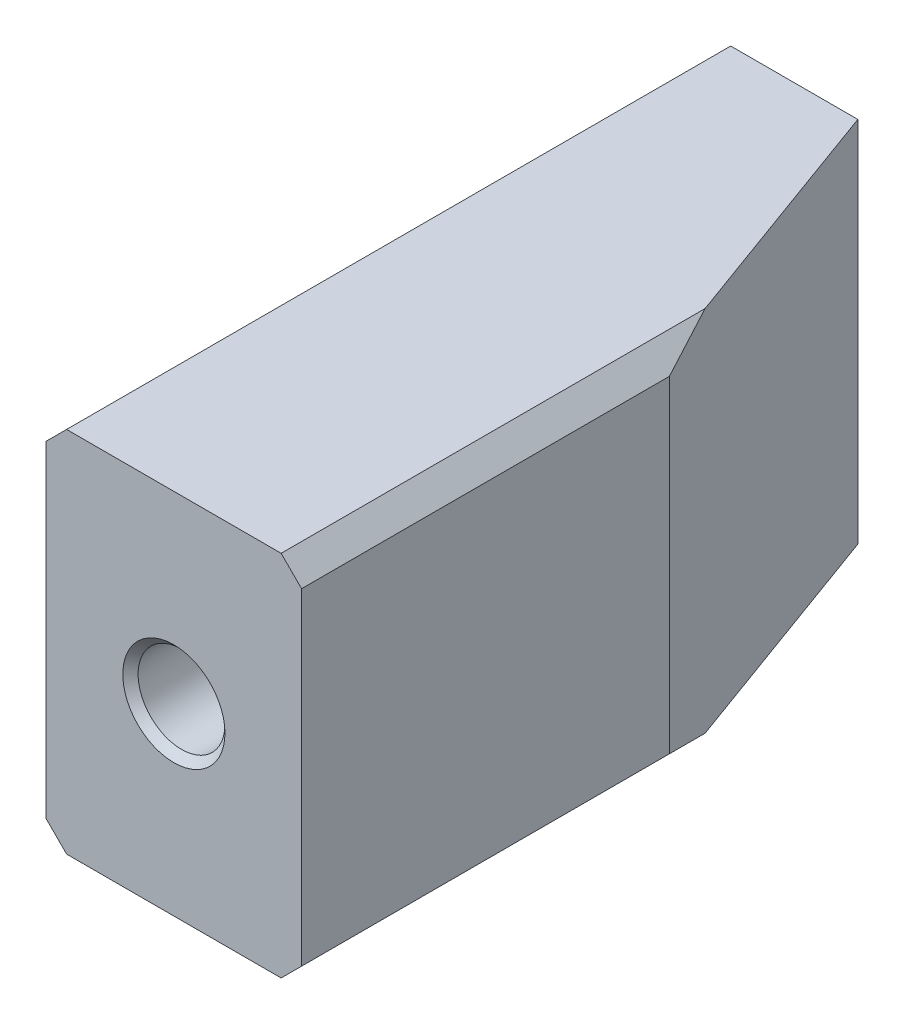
ISO-10303-21;
HEADER;
FILE_DESCRIPTION(('STEP AP214'),'2;1');
FILE_NAME('part.step','',(''),(''),'','','');
FILE_SCHEMA(('AUTOMOTIVE_DESIGN { 1 0 10303 214 1 1 1 1 }'));
ENDSEC;
DATA;
#1=APPLICATION_CONTEXT('core data for automotive mechanical design processes');
#2=APPLICATION_PROTOCOL_DEFINITION('international standard','automotive_design',2000,#1);
#3=PRODUCT_CONTEXT('',#1,'mechanical');
#4=PRODUCT('Part','Part','',(#3));
#5=PRODUCT_RELATED_PRODUCT_CATEGORY('part','',(#4));
#6=PRODUCT_DEFINITION_FORMATION('','',#4);
#7=PRODUCT_DEFINITION_CONTEXT('part definition',#1,'design');
#8=PRODUCT_DEFINITION('design','',#6,#7);
#9=PRODUCT_DEFINITION_SHAPE('','',#8);
#10=(LENGTH_UNIT() NAMED_UNIT(*) SI_UNIT(.MILLI.,.METRE.));
#11=(NAMED_UNIT(*) PLANE_ANGLE_UNIT() SI_UNIT($,.RADIAN.));
#12=(NAMED_UNIT(*) SI_UNIT($,.STERADIAN.) SOLID_ANGLE_UNIT());
#13=UNCERTAINTY_MEASURE_WITH_UNIT(LENGTH_MEASURE(1.E-05),#10,'distance_accuracy_value','');
#14=(GEOMETRIC_REPRESENTATION_CONTEXT(3) GLOBAL_UNCERTAINTY_ASSIGNED_CONTEXT((#13)) GLOBAL_UNIT_ASSIGNED_CONTEXT((#10,
#11,#12)) REPRESENTATION_CONTEXT('',''));
#15=CARTESIAN_POINT('',(0.,0.,0.));
#16=DIRECTION('',(0.,0.,1.));
#17=DIRECTION('',(1.,0.,0.));
#18=AXIS2_PLACEMENT_3D('',#15,#16,#17);
#19=CARTESIAN_POINT('',(-187.,-23.85,36.));
#20=DIRECTION('',(-1.,0.,0.));
#21=DIRECTION('',(0.,0.,1.));
#22=AXIS2_PLACEMENT_3D('',#19,#20,#21);
#23=PLANE('',#22);
#24=DIRECTION('',(0.,-1.,0.));
#25=VECTOR('',#24,1.);
#26=CARTESIAN_POINT('',(-187.,-23.85,36.));
#27=LINE('',#26,#25);
#28=CARTESIAN_POINT('',(-187.,-25.85,36.));
#29=VERTEX_POINT('',#28);
#30=CARTESIAN_POINT('',(-187.,-57.85,36.));
#31=VERTEX_POINT('',#30);
#32=EDGE_CURVE('E124',#29,#31,#27,.T.);
#33=ORIENTED_EDGE('',*,*,#32,.F.);
#34=DIRECTION('',(0.,0.,-1.));
#35=VECTOR('',#34,1.);
#36=CARTESIAN_POINT('',(-187.,-25.85,-29.));
#37=LINE('',#36,#35);
#38=CARTESIAN_POINT('',(-187.,-25.85,-29.));
#39=VERTEX_POINT('',#38);
#40=EDGE_CURVE('E178',#29,#39,#37,.T.);
#41=ORIENTED_EDGE('',*,*,#40,.T.);
#42=DIRECTION('',(0.,-1.,0.));
#43=VECTOR('',#42,1.);
#44=CARTESIAN_POINT('',(-187.,-23.85,-29.));
#45=LINE('',#44,#43);
#46=CARTESIAN_POINT('',(-187.,-57.85,-29.));
#47=VERTEX_POINT('',#46);
#48=EDGE_CURVE('E106',#39,#47,#45,.T.);
#49=ORIENTED_EDGE('',*,*,#48,.T.);
#50=DIRECTION('',(0.,0.,1.));
#51=VECTOR('',#50,1.);
#52=CARTESIAN_POINT('',(-187.,-57.85,36.));
#53=LINE('',#52,#51);
#54=EDGE_CURVE('E132',#47,#31,#53,.T.);
#55=ORIENTED_EDGE('',*,*,#54,.T.);
#56=EDGE_LOOP('',(#33,#41,#49,#55));
#57=FACE_BOUND('',#56,.T.);
#58=ADVANCED_FACE('F16',(#57),#23,.T.);
#59=CARTESIAN_POINT('',(-187.,-23.85,-29.));
#60=DIRECTION('',(0.,-1.,0.));
#61=DIRECTION('',(0.,0.,-1.));
#62=AXIS2_PLACEMENT_3D('',#59,#60,#61);
#63=PLANE('',#62);
#64=DIRECTION('',(1.,0.,0.));
#65=VECTOR('',#64,1.);
#66=CARTESIAN_POINT('',(-187.,-23.85,-29.));
#67=LINE('',#66,#65);
#68=CARTESIAN_POINT('',(-185.,-23.85,-29.));
#69=VERTEX_POINT('',#68);
#70=CARTESIAN_POINT('',(-172.55513679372,-23.85,-29.));
#71=VERTEX_POINT('',#70);
#72=EDGE_CURVE('E90',#69,#71,#67,.T.);
#73=ORIENTED_EDGE('',*,*,#72,.F.);
#74=DIRECTION('',(0.,0.,1.));
#75=VECTOR('',#74,1.);
#76=CARTESIAN_POINT('',(-185.,-23.85,36.));
#77=LINE('',#76,#75);
#78=CARTESIAN_POINT('',(-185.,-23.85,36.));
#79=VERTEX_POINT('',#78);
#80=EDGE_CURVE('E165',#69,#79,#77,.T.);
#81=ORIENTED_EDGE('',*,*,#80,.T.);
#82=DIRECTION('',(-1.,0.,0.));
#83=VECTOR('',#82,1.);
#84=CARTESIAN_POINT('',(-162.,-23.85,36.));
#85=LINE('',#84,#83);
#86=CARTESIAN_POINT('',(-164.,-23.85,36.));
#87=VERTEX_POINT('',#86);
#88=EDGE_CURVE('E128',#87,#79,#85,.T.);
#89=ORIENTED_EDGE('',*,*,#88,.F.);
#90=DIRECTION('',(0.,0.,-1.));
#91=VECTOR('',#90,1.);
#92=CARTESIAN_POINT('',(-164.,-23.85,0.));
#93=LINE('',#92,#91);
#94=CARTESIAN_POINT('',(-164.,-23.85,-5.49495483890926));
#95=VERTEX_POINT('',#94);
#96=EDGE_CURVE('E111',#87,#95,#93,.T.);
#97=ORIENTED_EDGE('',*,*,#96,.T.);
#98=DIRECTION('',(0.342020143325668,0.,0.939692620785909));
#99=VECTOR('',#98,1.);
#100=CARTESIAN_POINT('',(-172.55513679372,-23.85,-29.));
#101=LINE('',#100,#99);
#102=EDGE_CURVE('E101',#71,#95,#101,.T.);
#103=ORIENTED_EDGE('',*,*,#102,.F.);
#104=EDGE_LOOP('',(#73,#81,#89,#97,#103));
#105=FACE_BOUND('',#104,.T.);
#106=ADVANCED_FACE('F108',(#105),#63,.F.);
#107=CARTESIAN_POINT('',(-187.,-59.85,-29.));
#108=DIRECTION('',(0.,-1.,0.));
#109=DIRECTION('',(0.,0.,-1.));
#110=AXIS2_PLACEMENT_3D('',#107,#108,#109);
#111=PLANE('',#110);
#112=DIRECTION('',(-1.,0.,0.));
#113=VECTOR('',#112,1.);
#114=CARTESIAN_POINT('',(-162.,-59.85,36.));
#115=LINE('',#114,#113);
#116=CARTESIAN_POINT('',(-164.,-59.85,36.));
#117=VERTEX_POINT('',#116);
#118=CARTESIAN_POINT('',(-185.,-59.85,36.));
#119=VERTEX_POINT('',#118);
#120=EDGE_CURVE('E119',#117,#119,#115,.T.);
#121=ORIENTED_EDGE('',*,*,#120,.T.);
#122=DIRECTION('',(0.,0.,-1.));
#123=VECTOR('',#122,1.);
#124=CARTESIAN_POINT('',(-185.,-59.85,-29.));
#125=LINE('',#124,#123);
#126=CARTESIAN_POINT('',(-185.,-59.85,-29.));
#127=VERTEX_POINT('',#126);
#128=EDGE_CURVE('E141',#119,#127,#125,.T.);
#129=ORIENTED_EDGE('',*,*,#128,.T.);
#130=DIRECTION('',(1.,0.,0.));
#131=VECTOR('',#130,1.);
#132=CARTESIAN_POINT('',(-187.,-59.85,-29.));
#133=LINE('',#132,#131);
#134=CARTESIAN_POINT('',(-172.55513679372,-59.85,-29.));
#135=VERTEX_POINT('',#134);
#136=EDGE_CURVE('E114',#127,#135,#133,.T.);
#137=ORIENTED_EDGE('',*,*,#136,.T.);
#138=DIRECTION('',(0.342020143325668,0.,0.939692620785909));
#139=VECTOR('',#138,1.);
#140=CARTESIAN_POINT('',(-172.55513679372,-59.85,-29.));
#141=LINE('',#140,#139);
#142=CARTESIAN_POINT('',(-164.,-59.85,-5.49495483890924));
#143=VERTEX_POINT('',#142);
#144=EDGE_CURVE('E102',#135,#143,#141,.T.);
#145=ORIENTED_EDGE('',*,*,#144,.T.);
#146=DIRECTION('',(0.,0.,1.));
#147=VECTOR('',#146,1.);
#148=CARTESIAN_POINT('',(-164.,-59.85,-29.));
#149=LINE('',#148,#147);
#150=EDGE_CURVE('E149',#143,#117,#149,.T.);
#151=ORIENTED_EDGE('',*,*,#150,.T.);
#152=EDGE_LOOP('',(#121,#129,#137,#145,#151));
#153=FACE_BOUND('',#152,.T.);
#154=ADVANCED_FACE('F197',(#153),#111,.T.);
#155=CARTESIAN_POINT('',(-162.,-23.85,0.));
#156=DIRECTION('',(1.,0.,0.));
#157=DIRECTION('',(0.,0.,-1.));
#158=AXIS2_PLACEMENT_3D('',#155,#156,#157);
#159=PLANE('',#158);
#160=DIRECTION('',(0.,-1.,0.));
#161=VECTOR('',#160,1.);
#162=CARTESIAN_POINT('',(-162.,-23.85,36.));
#163=LINE('',#162,#161);
#164=CARTESIAN_POINT('',(-162.,-25.85,36.));
#165=VERTEX_POINT('',#164);
#166=CARTESIAN_POINT('',(-162.,-57.85,36.));
#167=VERTEX_POINT('',#166);
#168=EDGE_CURVE('E129',#165,#167,#163,.T.);
#169=ORIENTED_EDGE('',*,*,#168,.T.);
#170=DIRECTION('',(0.,0.,-1.));
#171=VECTOR('',#170,1.);
#172=CARTESIAN_POINT('',(-162.,-57.85,0.));
#173=LINE('',#172,#171);
#174=CARTESIAN_POINT('',(-162.,-57.85,0.));
#175=VERTEX_POINT('',#174);
#176=EDGE_CURVE('E37',#167,#175,#173,.T.);
#177=ORIENTED_EDGE('',*,*,#176,.T.);
#178=DIRECTION('',(0.,1.,0.));
#179=VECTOR('',#178,1.);
#180=CARTESIAN_POINT('',(-162.,-23.85,0.));
#181=LINE('',#180,#179);
#182=CARTESIAN_POINT('',(-162.,-25.85,0.));
#183=VERTEX_POINT('',#182);
#184=EDGE_CURVE('E138',#175,#183,#181,.T.);
#185=ORIENTED_EDGE('',*,*,#184,.T.);
#186=DIRECTION('',(0.,0.,1.));
#187=VECTOR('',#186,1.);
#188=CARTESIAN_POINT('',(-162.,-25.85,36.));
#189=LINE('',#188,#187);
#190=EDGE_CURVE('E143',#183,#165,#189,.T.);
#191=ORIENTED_EDGE('',*,*,#190,.T.);
#192=EDGE_LOOP('',(#169,#177,#185,#191));
#193=FACE_BOUND('',#192,.T.);
#194=ADVANCED_FACE('F199',(#193),#159,.T.);
#195=CARTESIAN_POINT('',(-162.,-23.85,36.));
#196=DIRECTION('',(0.,0.,1.));
#197=DIRECTION('',(1.,0.,0.));
#198=AXIS2_PLACEMENT_3D('',#195,#196,#197);
#199=PLANE('',#198);
#200=CARTESIAN_POINT('',(-174.5,-41.85,36.));
#201=DIRECTION('',(0.,0.,1.));
#202=DIRECTION('',(1.,0.,0.));
#203=AXIS2_PLACEMENT_3D('',#200,#201,#202);
#204=CIRCLE('',#203,5.);
#205=CARTESIAN_POINT('',(-169.5,-41.85,36.));
#206=VERTEX_POINT('',#205);
#207=EDGE_CURVE('E125',#206,#206,#204,.F.);
#208=ORIENTED_EDGE('',*,*,#207,.T.);
#209=EDGE_LOOP('',(#208));
#210=FACE_BOUND('',#209,.T.);
#211=ORIENTED_EDGE('',*,*,#88,.T.);
#212=DIRECTION('',(-0.707106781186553,-0.707106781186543,0.));
#213=VECTOR('',#212,1.);
#214=CARTESIAN_POINT('',(-173.5,-12.3500000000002,36.));
#215=LINE('',#214,#213);
#216=EDGE_CURVE('E154',#79,#29,#215,.T.);
#217=ORIENTED_EDGE('',*,*,#216,.T.);
#218=ORIENTED_EDGE('',*,*,#32,.T.);
#219=DIRECTION('',(-0.707106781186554,0.707106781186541,0.));
#220=VECTOR('',#219,1.);
#221=CARTESIAN_POINT('',(-191.5,-53.35,36.));
#222=LINE('',#221,#220);
#223=EDGE_CURVE('E157',#31,#119,#222,.F.);
#224=ORIENTED_EDGE('',*,*,#223,.T.);
#225=ORIENTED_EDGE('',*,*,#120,.F.);
#226=DIRECTION('',(-0.707106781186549,-0.707106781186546,0.));
#227=VECTOR('',#226,1.);
#228=CARTESIAN_POINT('',(-145.,-40.85,36.));
#229=LINE('',#228,#227);
#230=EDGE_CURVE('E161',#117,#167,#229,.F.);
#231=ORIENTED_EDGE('',*,*,#230,.T.);
#232=ORIENTED_EDGE('',*,*,#168,.F.);
#233=DIRECTION('',(-0.707106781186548,0.707106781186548,0.));
#234=VECTOR('',#233,1.);
#235=CARTESIAN_POINT('',(-163.,-24.85,36.));
#236=LINE('',#235,#234);
#237=EDGE_CURVE('E163',#165,#87,#236,.T.);
#238=ORIENTED_EDGE('',*,*,#237,.T.);
#239=EDGE_LOOP('',(#211,#217,#218,#224,#225,#231,#232,#238));
#240=FACE_BOUND('',#239,.T.);
#241=ADVANCED_FACE('F188',(#210,#240),#199,.T.);
#242=CARTESIAN_POINT('',(-174.5,-41.85,16.));
#243=DIRECTION('',(0.,0.,1.));
#244=DIRECTION('',(1.,0.,0.));
#245=AXIS2_PLACEMENT_3D('',#242,#243,#244);
#246=CONICAL_SURFACE('',#245,4.25,1.02974425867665);
#247=CARTESIAN_POINT('',(-174.5,-41.85,16.));
#248=DIRECTION('',(0.,0.,-1.));
#249=DIRECTION('',(-1.,0.,0.));
#250=AXIS2_PLACEMENT_3D('',#247,#248,#249);
#251=CIRCLE('',#250,4.25);
#252=CARTESIAN_POINT('',(-178.75,-41.85,16.));
#253=VERTEX_POINT('',#252);
#254=EDGE_CURVE('E123',#253,#253,#251,.T.);
#255=ORIENTED_EDGE('',*,*,#254,.F.);
#256=EDGE_LOOP('',(#255));
#257=FACE_BOUND('',#256,.T.);
#258=CARTESIAN_POINT('',(-174.5,-41.85,13.4463423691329));
#259=VERTEX_POINT('',#258);
#260=VERTEX_LOOP('',#259);
#261=FACE_BOUND('',#260,.T.);
#262=ADVANCED_FACE('F285',(#257,#261),#246,.F.);
#263=CARTESIAN_POINT('',(-174.5,-41.85,36.));
#264=DIRECTION('',(0.,0.,-1.));
#265=DIRECTION('',(-1.,0.,0.));
#266=AXIS2_PLACEMENT_3D('',#263,#264,#265);
#267=CYLINDRICAL_SURFACE('',#266,4.25);
#268=CARTESIAN_POINT('',(-174.5,-41.85,35.25));
#269=DIRECTION('',(0.,0.,1.));
#270=DIRECTION('',(1.,0.,0.));
#271=AXIS2_PLACEMENT_3D('',#268,#269,#270);
#272=CIRCLE('',#271,4.25);
#273=CARTESIAN_POINT('',(-170.25,-41.85,35.25));
#274=VERTEX_POINT('',#273);
#275=EDGE_CURVE('E120',#274,#274,#272,.T.);
#276=ORIENTED_EDGE('',*,*,#275,.T.);
#277=EDGE_LOOP('',(#276));
#278=FACE_BOUND('',#277,.T.);
#279=ORIENTED_EDGE('',*,*,#254,.T.);
#280=EDGE_LOOP('',(#279));
#281=FACE_BOUND('',#280,.T.);
#282=ADVANCED_FACE('F275',(#278,#281),#267,.F.);
#283=CARTESIAN_POINT('',(-174.5,-41.85,36.));
#284=DIRECTION('',(0.,0.,1.));
#285=DIRECTION('',(1.,0.,0.));
#286=AXIS2_PLACEMENT_3D('',#283,#284,#285);
#287=CONICAL_SURFACE('',#286,5.,0.785398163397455);
#288=ORIENTED_EDGE('',*,*,#275,.F.);
#289=EDGE_LOOP('',(#288));
#290=FACE_BOUND('',#289,.T.);
#291=ORIENTED_EDGE('',*,*,#207,.F.);
#292=EDGE_LOOP('',(#291));
#293=FACE_BOUND('',#292,.T.);
#294=ADVANCED_FACE('F266',(#290,#293),#287,.F.);
#295=CARTESIAN_POINT('',(-187.,-23.85,-29.));
#296=DIRECTION('',(0.,0.,-1.));
#297=DIRECTION('',(-1.,0.,0.));
#298=AXIS2_PLACEMENT_3D('',#295,#296,#297);
#299=PLANE('',#298);
#300=ORIENTED_EDGE('',*,*,#48,.F.);
#301=DIRECTION('',(0.707106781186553,0.707106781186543,0.));
#302=VECTOR('',#301,1.);
#303=CARTESIAN_POINT('',(-186.,-24.85,-29.));
#304=LINE('',#303,#302);
#305=EDGE_CURVE('E97',#39,#69,#304,.T.);
#306=ORIENTED_EDGE('',*,*,#305,.T.);
#307=ORIENTED_EDGE('',*,*,#72,.T.);
#308=DIRECTION('',(0.,-1.,0.));
#309=VECTOR('',#308,1.);
#310=CARTESIAN_POINT('',(-172.55513679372,-23.85,-29.));
#311=LINE('',#310,#309);
#312=EDGE_CURVE('E95',#71,#135,#311,.T.);
#313=ORIENTED_EDGE('',*,*,#312,.T.);
#314=ORIENTED_EDGE('',*,*,#136,.F.);
#315=DIRECTION('',(0.707106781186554,-0.707106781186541,0.));
#316=VECTOR('',#315,1.);
#317=CARTESIAN_POINT('',(-204.,-40.8500000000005,-29.));
#318=LINE('',#317,#316);
#319=EDGE_CURVE('E181',#127,#47,#318,.F.);
#320=ORIENTED_EDGE('',*,*,#319,.T.);
#321=EDGE_LOOP('',(#300,#306,#307,#313,#314,#320));
#322=FACE_BOUND('',#321,.T.);
#323=ADVANCED_FACE('F93',(#322),#299,.T.);
#324=CARTESIAN_POINT('',(-172.55513679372,-23.85,-29.));
#325=DIRECTION('',(0.939692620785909,0.,-0.342020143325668));
#326=DIRECTION('',(-0.342020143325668,0.,-0.939692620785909));
#327=AXIS2_PLACEMENT_3D('',#324,#325,#326);
#328=PLANE('',#327);
#329=ORIENTED_EDGE('',*,*,#184,.F.);
#330=DIRECTION('',(0.323615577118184,0.323615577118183,0.889126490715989));
#331=VECTOR('',#330,1.);
#332=CARTESIAN_POINT('',(-167.889009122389,-63.7390091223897,-16.1799195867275));
#333=LINE('',#332,#331);
#334=EDGE_CURVE('E11',#175,#143,#333,.F.);
#335=ORIENTED_EDGE('',*,*,#334,.T.);
#336=ORIENTED_EDGE('',*,*,#144,.F.);
#337=ORIENTED_EDGE('',*,*,#312,.F.);
#338=ORIENTED_EDGE('',*,*,#102,.T.);
#339=DIRECTION('',(0.323615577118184,-0.323615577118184,0.889126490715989));
#340=VECTOR('',#339,1.);
#341=CARTESIAN_POINT('',(-171.659182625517,-16.1908173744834,-26.5383861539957));
#342=LINE('',#341,#340);
#343=EDGE_CURVE('E24',#95,#183,#342,.T.);
#344=ORIENTED_EDGE('',*,*,#343,.T.);
#345=EDGE_LOOP('',(#329,#335,#336,#337,#338,#344));
#346=FACE_BOUND('',#345,.T.);
#347=ADVANCED_FACE('F104',(#346),#328,.T.);
#348=CARTESIAN_POINT('',(-187.,-25.85,36.));
#349=DIRECTION('',(-0.707106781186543,0.707106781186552,0.));
#350=DIRECTION('',(-0.707106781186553,-0.707106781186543,0.));
#351=AXIS2_PLACEMENT_3D('',#348,#349,#350);
#352=PLANE('',#351);
#353=ORIENTED_EDGE('',*,*,#216,.F.);
#354=ORIENTED_EDGE('',*,*,#80,.F.);
#355=ORIENTED_EDGE('',*,*,#305,.F.);
#356=ORIENTED_EDGE('',*,*,#40,.F.);
#357=EDGE_LOOP('',(#353,#354,#355,#356));
#358=FACE_BOUND('',#357,.T.);
#359=ADVANCED_FACE('F191',(#358),#352,.T.);
#360=CARTESIAN_POINT('',(-185.,-59.85,-29.));
#361=DIRECTION('',(0.707106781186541,0.707106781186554,0.));
#362=DIRECTION('',(-0.707106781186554,0.707106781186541,0.));
#363=AXIS2_PLACEMENT_3D('',#360,#361,#362);
#364=PLANE('',#363);
#365=ORIENTED_EDGE('',*,*,#223,.F.);
#366=ORIENTED_EDGE('',*,*,#54,.F.);
#367=ORIENTED_EDGE('',*,*,#319,.F.);
#368=ORIENTED_EDGE('',*,*,#128,.F.);
#369=EDGE_LOOP('',(#365,#366,#367,#368));
#370=FACE_BOUND('',#369,.T.);
#371=ADVANCED_FACE('F196',(#370),#364,.F.);
#372=CARTESIAN_POINT('',(-164.,-59.85,-29.));
#373=DIRECTION('',(-0.707106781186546,0.707106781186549,0.));
#374=DIRECTION('',(-0.707106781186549,-0.707106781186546,0.));
#375=AXIS2_PLACEMENT_3D('',#372,#373,#374);
#376=PLANE('',#375);
#377=ORIENTED_EDGE('',*,*,#334,.F.);
#378=ORIENTED_EDGE('',*,*,#176,.F.);
#379=ORIENTED_EDGE('',*,*,#230,.F.);
#380=ORIENTED_EDGE('',*,*,#150,.F.);
#381=EDGE_LOOP('',(#377,#378,#379,#380));
#382=FACE_BOUND('',#381,.T.);
#383=ADVANCED_FACE('F216',(#382),#376,.F.);
#384=CARTESIAN_POINT('',(-162.,-25.85,0.));
#385=DIRECTION('',(0.707106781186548,0.707106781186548,0.));
#386=DIRECTION('',(-0.707106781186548,0.707106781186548,0.));
#387=AXIS2_PLACEMENT_3D('',#384,#385,#386);
#388=PLANE('',#387);
#389=ORIENTED_EDGE('',*,*,#343,.F.);
#390=ORIENTED_EDGE('',*,*,#96,.F.);
#391=ORIENTED_EDGE('',*,*,#237,.F.);
#392=ORIENTED_EDGE('',*,*,#190,.F.);
#393=EDGE_LOOP('',(#389,#390,#391,#392));
#394=FACE_BOUND('',#393,.T.);
#395=ADVANCED_FACE('F18',(#394),#388,.T.);
#396=CLOSED_SHELL('',(#58,#106,#154,#194,#241,#262,#282,#294,#323,#347,#359,#371,#383,#395));
#397=MANIFOLD_SOLID_BREP('B1',#396);
#398=ADVANCED_BREP_SHAPE_REPRESENTATION('',(#18,#397),#14);
#399=SHAPE_DEFINITION_REPRESENTATION(#9,#398);
ENDSEC;
END-ISO-10303-21;
